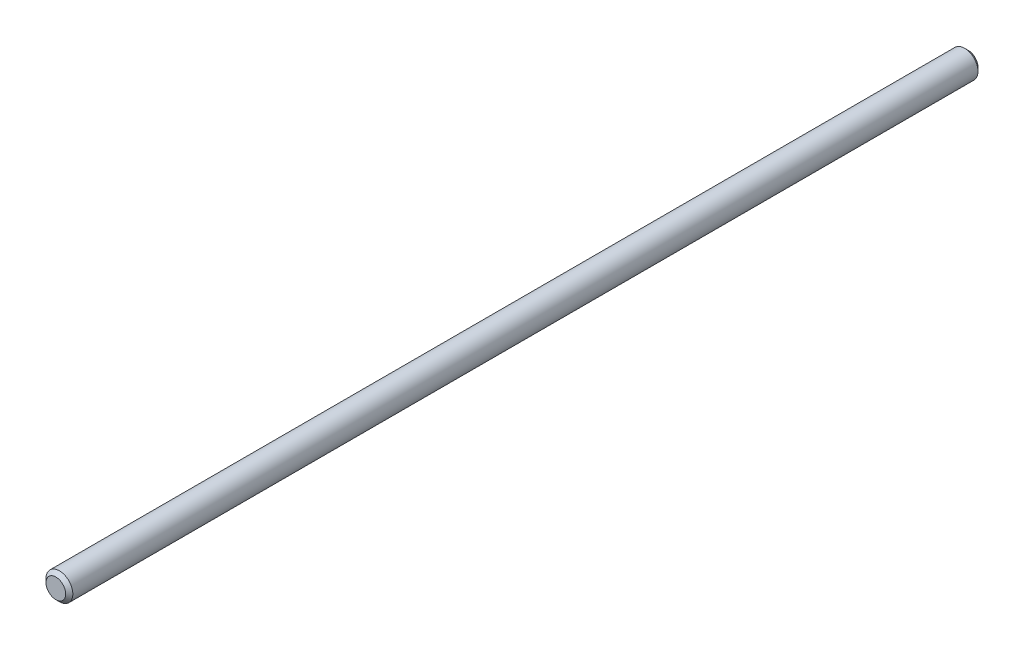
from build123d import *

# Parameters (mm, degrees)
ESQUISSE1_R      = 0.75
EXTRUSION1_DEPTH = 51
CHANFREIN1_SIZE  = 0.2


with BuildPart() as part:
    # Esquisse1 → Extrusion1 (new body)
    with BuildSketch(Plane.XY):
        Circle(ESQUISSE1_R)
    extrude(amount=EXTRUSION1_DEPTH)

    # Chanfrein1
    chanfrein1_edges = [part.edges().sort_by_distance(p)[0] for p in [
        (-0.75, 0, 0),
        (-0.75, 0, 51),
    ]]
    chamfer(chanfrein1_edges, length=CHANFREIN1_SIZE)


solid = part.part
